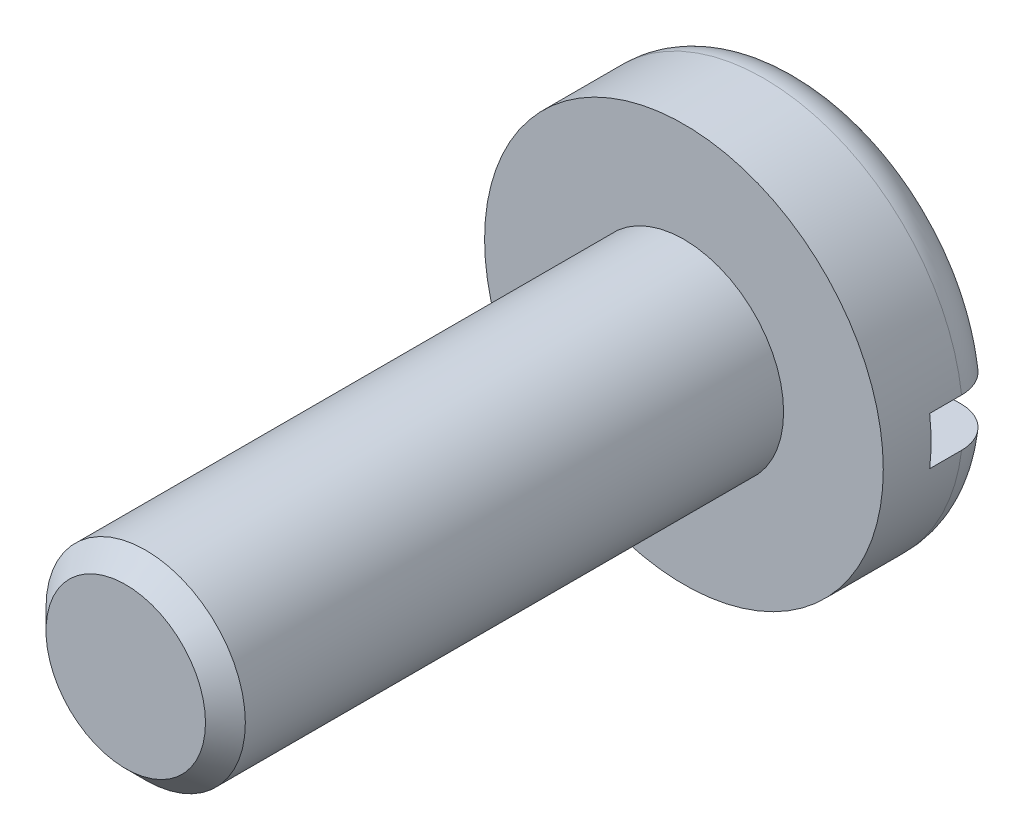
from build123d import *

# Parameters (mm, degrees)
ESQUISSE2_W             = 5
ESQUISSE2_H             = 0.6
ENLEV_MAT_EXTRU_1_DEPTH = 0.9
ESQUISSE3_W             = 1.25
ESQUISSE3_H             = 7
CHANFREIN1_SIZE         = 0.25


with BuildPart() as part:
    # Esquisse1 → Base-R_volution (revolve)
    with BuildSketch(Plane(origin=(0, 0, 0), x_dir=(1, 0, 0), z_dir=(0, 1, 0))):
        with BuildLine():
            Line((0, 0), (2.5, 0))
            Line((2.5, 0), (2.5, 1))
            ThreePointArc((2.5, 1), (2.353553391, 1.353553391), (2, 1.5))
            Line((2, 1.5), (0, 1.5))
            Line((0, 1.5), (0, 0))
        make_face()
    revolve(axis=Axis((0, 0, 0), (0, 0, -1)))

    # Esquisse2 → Enlev. mat.-Extru.1 (cut)
    with BuildSketch(Plane.XY.offset(-1.5)):
        Rectangle(ESQUISSE2_W, ESQUISSE2_H)
    extrude(amount=ENLEV_MAT_EXTRU_1_DEPTH, mode=Mode.SUBTRACT)

    # Esquisse3 → Boss.-R_vol.1 (revolve)
    with BuildSketch(Plane(origin=(0, 0, 0), x_dir=(1, 0, 0), z_dir=(0, 1, 0))):
        with Locations((0.625, -3.5)):
            Rectangle(ESQUISSE3_W, ESQUISSE3_H)
    revolve(axis=Axis((0, 0, 0), (0, 0, 1)))

    # Chanfrein1
    chanfrein1_edges = [part.edges().sort_by_distance(p)[0] for p in [
        (-1.25, 0, 7),
    ]]
    chamfer(chanfrein1_edges, length=CHANFREIN1_SIZE)


solid = part.part
